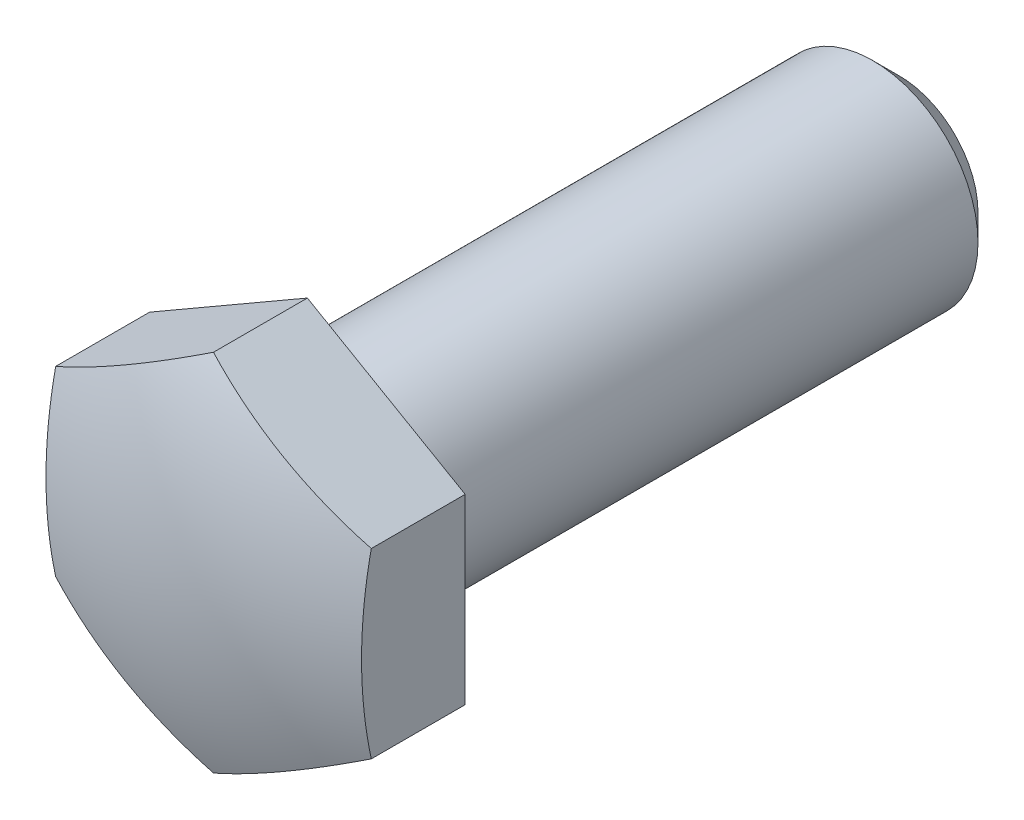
ISO-10303-21;
HEADER;
FILE_DESCRIPTION(('STEP AP214'),'2;1');
FILE_NAME('part.step','',(''),(''),'','','');
FILE_SCHEMA(('AUTOMOTIVE_DESIGN { 1 0 10303 214 1 1 1 1 }'));
ENDSEC;
DATA;
#1=APPLICATION_CONTEXT('core data for automotive mechanical design processes');
#2=APPLICATION_PROTOCOL_DEFINITION('international standard','automotive_design',2000,#1);
#3=PRODUCT_CONTEXT('',#1,'mechanical');
#4=PRODUCT('Part','Part','',(#3));
#5=PRODUCT_RELATED_PRODUCT_CATEGORY('part','',(#4));
#6=PRODUCT_DEFINITION_FORMATION('','',#4);
#7=PRODUCT_DEFINITION_CONTEXT('part definition',#1,'design');
#8=PRODUCT_DEFINITION('design','',#6,#7);
#9=PRODUCT_DEFINITION_SHAPE('','',#8);
#10=(LENGTH_UNIT() NAMED_UNIT(*) SI_UNIT(.MILLI.,.METRE.));
#11=(NAMED_UNIT(*) PLANE_ANGLE_UNIT() SI_UNIT($,.RADIAN.));
#12=(NAMED_UNIT(*) SI_UNIT($,.STERADIAN.) SOLID_ANGLE_UNIT());
#13=UNCERTAINTY_MEASURE_WITH_UNIT(LENGTH_MEASURE(1.E-05),#10,'distance_accuracy_value','');
#14=(GEOMETRIC_REPRESENTATION_CONTEXT(3) GLOBAL_UNCERTAINTY_ASSIGNED_CONTEXT((#13)) GLOBAL_UNIT_ASSIGNED_CONTEXT((#10,
#11,#12)) REPRESENTATION_CONTEXT('',''));
#15=CARTESIAN_POINT('',(0.,0.,0.));
#16=DIRECTION('',(0.,0.,1.));
#17=DIRECTION('',(1.,0.,0.));
#18=AXIS2_PLACEMENT_3D('',#15,#16,#17);
#19=CARTESIAN_POINT('',(8.,0.,0.));
#20=DIRECTION('',(0.,0.,1.));
#21=DIRECTION('',(1.,0.,0.));
#22=AXIS2_PLACEMENT_3D('',#19,#20,#21);
#23=PLANE('',#22);
#24=CARTESIAN_POINT('',(0.,0.,0.));
#25=DIRECTION('',(0.,0.,1.));
#26=DIRECTION('',(1.,0.,0.));
#27=AXIS2_PLACEMENT_3D('',#24,#25,#26);
#28=CIRCLE('',#27,8.);
#29=CARTESIAN_POINT('',(8.,0.,0.));
#30=VERTEX_POINT('',#29);
#31=EDGE_CURVE('E115',#30,#30,#28,.T.);
#32=ORIENTED_EDGE('',*,*,#31,.T.);
#33=EDGE_LOOP('',(#32));
#34=FACE_BOUND('',#33,.T.);
#35=DIRECTION('',(-0.86602540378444,-0.5,0.));
#36=VECTOR('',#35,1.);
#37=CARTESIAN_POINT('',(12.,-6.92820323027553,0.));
#38=LINE('',#37,#36);
#39=CARTESIAN_POINT('',(12.,-6.92820323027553,0.));
#40=VERTEX_POINT('',#39);
#41=CARTESIAN_POINT('',(0.,-13.856406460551,0.));
#42=VERTEX_POINT('',#41);
#43=EDGE_CURVE('E89',#40,#42,#38,.T.);
#44=ORIENTED_EDGE('',*,*,#43,.T.);
#45=DIRECTION('',(0.86602540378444,-0.5,0.));
#46=VECTOR('',#45,1.);
#47=CARTESIAN_POINT('',(-12.,-6.92820323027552,0.));
#48=LINE('',#47,#46);
#49=CARTESIAN_POINT('',(-12.,-6.92820323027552,0.));
#50=VERTEX_POINT('',#49);
#51=EDGE_CURVE('E87',#50,#42,#48,.T.);
#52=ORIENTED_EDGE('',*,*,#51,.F.);
#53=DIRECTION('',(0.,-1.,0.));
#54=VECTOR('',#53,1.);
#55=CARTESIAN_POINT('',(-12.,6.92820323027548,0.));
#56=LINE('',#55,#54);
#57=CARTESIAN_POINT('',(-12.,6.92820323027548,0.));
#58=VERTEX_POINT('',#57);
#59=EDGE_CURVE('E37',#58,#50,#56,.T.);
#60=ORIENTED_EDGE('',*,*,#59,.F.);
#61=DIRECTION('',(0.866025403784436,0.5,0.));
#62=VECTOR('',#61,1.);
#63=CARTESIAN_POINT('',(-12.,6.92820323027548,0.));
#64=LINE('',#63,#62);
#65=CARTESIAN_POINT('',(0.,13.8564064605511,0.));
#66=VERTEX_POINT('',#65);
#67=EDGE_CURVE('E77',#58,#66,#64,.T.);
#68=ORIENTED_EDGE('',*,*,#67,.T.);
#69=DIRECTION('',(-0.866025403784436,0.5,0.));
#70=VECTOR('',#69,1.);
#71=CARTESIAN_POINT('',(12.,6.92820323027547,0.));
#72=LINE('',#71,#70);
#73=CARTESIAN_POINT('',(12.,6.92820323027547,0.));
#74=VERTEX_POINT('',#73);
#75=EDGE_CURVE('E83',#74,#66,#72,.T.);
#76=ORIENTED_EDGE('',*,*,#75,.F.);
#77=DIRECTION('',(0.,-1.,0.));
#78=VECTOR('',#77,1.);
#79=CARTESIAN_POINT('',(12.,6.92820323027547,0.));
#80=LINE('',#79,#78);
#81=EDGE_CURVE('E95',#74,#40,#80,.T.);
#82=ORIENTED_EDGE('',*,*,#81,.T.);
#83=EDGE_LOOP('',(#44,#52,#60,#68,#76,#82));
#84=FACE_BOUND('',#83,.T.);
#85=ADVANCED_FACE('F14',(#34,#84),#23,.F.);
#86=CARTESIAN_POINT('',(0.,0.,15.));
#87=DIRECTION('',(0.,0.,1.));
#88=DIRECTION('',(1.,0.,0.));
#89=AXIS2_PLACEMENT_3D('',#86,#87,#88);
#90=CYLINDRICAL_SURFACE('',#89,8.);
#91=CARTESIAN_POINT('',(0.,0.,-43.));
#92=DIRECTION('',(0.,0.,1.));
#93=DIRECTION('',(1.,0.,0.));
#94=AXIS2_PLACEMENT_3D('',#91,#92,#93);
#95=CIRCLE('',#94,8.);
#96=CARTESIAN_POINT('',(8.,0.,-43.));
#97=VERTEX_POINT('',#96);
#98=EDGE_CURVE('E22',#97,#97,#95,.T.);
#99=ORIENTED_EDGE('',*,*,#98,.T.);
#100=EDGE_LOOP('',(#99));
#101=FACE_BOUND('',#100,.T.);
#102=ORIENTED_EDGE('',*,*,#31,.F.);
#103=EDGE_LOOP('',(#102));
#104=FACE_BOUND('',#103,.T.);
#105=ADVANCED_FACE('F120',(#101,#104),#90,.T.);
#106=CARTESIAN_POINT('',(0.,0.,-45.));
#107=DIRECTION('',(0.,0.,1.));
#108=DIRECTION('',(1.,0.,0.));
#109=AXIS2_PLACEMENT_3D('',#106,#107,#108);
#110=PLANE('',#109);
#111=CARTESIAN_POINT('',(0.,0.,-45.));
#112=DIRECTION('',(0.,0.,1.));
#113=DIRECTION('',(1.,0.,0.));
#114=AXIS2_PLACEMENT_3D('',#111,#112,#113);
#115=CIRCLE('',#114,6.);
#116=CARTESIAN_POINT('',(6.,0.,-45.));
#117=VERTEX_POINT('',#116);
#118=EDGE_CURVE('E9',#117,#117,#115,.F.);
#119=ORIENTED_EDGE('',*,*,#118,.T.);
#120=EDGE_LOOP('',(#119));
#121=FACE_BOUND('',#120,.T.);
#122=ADVANCED_FACE('F141',(#121),#110,.F.);
#123=CARTESIAN_POINT('',(12.,-6.92820323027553,10.));
#124=DIRECTION('',(0.5,-0.86602540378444,0.));
#125=DIRECTION('',(0.86602540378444,0.5,0.));
#126=AXIS2_PLACEMENT_3D('',#123,#124,#125);
#127=PLANE('',#126);
#128=DIRECTION('',(0.,0.,-1.));
#129=VECTOR('',#128,1.);
#130=CARTESIAN_POINT('',(0.,-13.856406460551,10.));
#131=LINE('',#130,#129);
#132=CARTESIAN_POINT('',(0.,-13.856406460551,7.1403173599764));
#133=VERTEX_POINT('',#132);
#134=EDGE_CURVE('E29',#133,#42,#131,.T.);
#135=ORIENTED_EDGE('',*,*,#134,.T.);
#136=ORIENTED_EDGE('',*,*,#43,.F.);
#137=DIRECTION('',(0.,0.,-1.));
#138=VECTOR('',#137,1.);
#139=CARTESIAN_POINT('',(12.,-6.92820323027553,10.));
#140=LINE('',#139,#138);
#141=CARTESIAN_POINT('',(12.,-6.92820323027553,7.1403173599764));
#142=VERTEX_POINT('',#141);
#143=EDGE_CURVE('E100',#142,#40,#140,.T.);
#144=ORIENTED_EDGE('',*,*,#143,.F.);
#145=CARTESIAN_POINT('',(6.,-10.3923048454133,-25.));
#146=DIRECTION('',(0.5,-0.86602540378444,0.));
#147=DIRECTION('',(0.86602540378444,0.5,0.));
#148=AXIS2_PLACEMENT_3D('',#145,#146,#147);
#149=CIRCLE('',#148,32.8785644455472);
#150=EDGE_CURVE('E112',#133,#142,#149,.F.);
#151=ORIENTED_EDGE('',*,*,#150,.F.);
#152=EDGE_LOOP('',(#135,#136,#144,#151));
#153=FACE_BOUND('',#152,.T.);
#154=ADVANCED_FACE('F146',(#153),#127,.T.);
#155=CARTESIAN_POINT('',(12.,6.92820323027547,10.));
#156=DIRECTION('',(1.,0.,0.));
#157=DIRECTION('',(0.,1.,0.));
#158=AXIS2_PLACEMENT_3D('',#155,#156,#157);
#159=PLANE('',#158);
#160=ORIENTED_EDGE('',*,*,#143,.T.);
#161=ORIENTED_EDGE('',*,*,#81,.F.);
#162=DIRECTION('',(0.,0.,-1.));
#163=VECTOR('',#162,1.);
#164=CARTESIAN_POINT('',(12.,6.92820323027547,10.));
#165=LINE('',#164,#163);
#166=CARTESIAN_POINT('',(12.,6.92820323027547,7.1403173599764));
#167=VERTEX_POINT('',#166);
#168=EDGE_CURVE('E98',#167,#74,#165,.T.);
#169=ORIENTED_EDGE('',*,*,#168,.F.);
#170=CARTESIAN_POINT('',(12.,0.,-25.));
#171=DIRECTION('',(1.,0.,0.));
#172=DIRECTION('',(0.,1.,0.));
#173=AXIS2_PLACEMENT_3D('',#170,#171,#172);
#174=CIRCLE('',#173,32.8785644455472);
#175=EDGE_CURVE('E109',#142,#167,#174,.F.);
#176=ORIENTED_EDGE('',*,*,#175,.F.);
#177=EDGE_LOOP('',(#160,#161,#169,#176));
#178=FACE_BOUND('',#177,.T.);
#179=ADVANCED_FACE('F148',(#178),#159,.T.);
#180=CARTESIAN_POINT('',(12.,6.92820323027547,10.));
#181=DIRECTION('',(-0.5,-0.866025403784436,0.));
#182=DIRECTION('',(0.866025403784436,-0.5,0.));
#183=AXIS2_PLACEMENT_3D('',#180,#181,#182);
#184=PLANE('',#183);
#185=CARTESIAN_POINT('',(6.,10.3923048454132,-25.));
#186=DIRECTION('',(-0.5,-0.866025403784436,0.));
#187=DIRECTION('',(0.866025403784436,-0.5,0.));
#188=AXIS2_PLACEMENT_3D('',#185,#186,#187);
#189=CIRCLE('',#188,32.8785644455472);
#190=CARTESIAN_POINT('',(0.,13.8564064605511,7.1403173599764));
#191=VERTEX_POINT('',#190);
#192=EDGE_CURVE('E107',#191,#167,#189,.F.);
#193=ORIENTED_EDGE('',*,*,#192,.T.);
#194=ORIENTED_EDGE('',*,*,#168,.T.);
#195=ORIENTED_EDGE('',*,*,#75,.T.);
#196=DIRECTION('',(0.,0.,-1.));
#197=VECTOR('',#196,1.);
#198=CARTESIAN_POINT('',(0.,13.8564064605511,10.));
#199=LINE('',#198,#197);
#200=EDGE_CURVE('E73',#191,#66,#199,.T.);
#201=ORIENTED_EDGE('',*,*,#200,.F.);
#202=EDGE_LOOP('',(#193,#194,#195,#201));
#203=FACE_BOUND('',#202,.T.);
#204=ADVANCED_FACE('F151',(#203),#184,.F.);
#205=CARTESIAN_POINT('',(-12.,6.92820323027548,10.));
#206=DIRECTION('',(-0.5,0.866025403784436,0.));
#207=DIRECTION('',(-0.866025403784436,-0.5,0.));
#208=AXIS2_PLACEMENT_3D('',#205,#206,#207);
#209=PLANE('',#208);
#210=ORIENTED_EDGE('',*,*,#200,.T.);
#211=ORIENTED_EDGE('',*,*,#67,.F.);
#212=DIRECTION('',(0.,0.,-1.));
#213=VECTOR('',#212,1.);
#214=CARTESIAN_POINT('',(-12.,6.92820323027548,10.));
#215=LINE('',#214,#213);
#216=CARTESIAN_POINT('',(-12.,6.92820323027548,7.1403173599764));
#217=VERTEX_POINT('',#216);
#218=EDGE_CURVE('E66',#217,#58,#215,.T.);
#219=ORIENTED_EDGE('',*,*,#218,.F.);
#220=CARTESIAN_POINT('',(-6.,10.3923048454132,-25.));
#221=DIRECTION('',(-0.5,0.866025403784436,0.));
#222=DIRECTION('',(-0.866025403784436,-0.5,0.));
#223=AXIS2_PLACEMENT_3D('',#220,#221,#222);
#224=CIRCLE('',#223,32.8785644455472);
#225=EDGE_CURVE('E105',#191,#217,#224,.F.);
#226=ORIENTED_EDGE('',*,*,#225,.F.);
#227=EDGE_LOOP('',(#210,#211,#219,#226));
#228=FACE_BOUND('',#227,.T.);
#229=ADVANCED_FACE('F78',(#228),#209,.T.);
#230=CARTESIAN_POINT('',(-12.,6.92820323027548,10.));
#231=DIRECTION('',(1.,0.,0.));
#232=DIRECTION('',(0.,0.,-1.));
#233=AXIS2_PLACEMENT_3D('',#230,#231,#232);
#234=PLANE('',#233);
#235=CARTESIAN_POINT('',(-12.,0.,-25.));
#236=DIRECTION('',(1.,0.,0.));
#237=DIRECTION('',(0.,0.,-1.));
#238=AXIS2_PLACEMENT_3D('',#235,#236,#237);
#239=CIRCLE('',#238,32.8785644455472);
#240=CARTESIAN_POINT('',(-12.,-6.92820323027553,7.1403173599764));
#241=VERTEX_POINT('',#240);
#242=EDGE_CURVE('E70',#241,#217,#239,.F.);
#243=ORIENTED_EDGE('',*,*,#242,.T.);
#244=ORIENTED_EDGE('',*,*,#218,.T.);
#245=ORIENTED_EDGE('',*,*,#59,.T.);
#246=DIRECTION('',(0.,0.,-1.));
#247=VECTOR('',#246,1.);
#248=CARTESIAN_POINT('',(-12.,-6.92820323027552,10.));
#249=LINE('',#248,#247);
#250=EDGE_CURVE('E74',#241,#50,#249,.T.);
#251=ORIENTED_EDGE('',*,*,#250,.F.);
#252=EDGE_LOOP('',(#243,#244,#245,#251));
#253=FACE_BOUND('',#252,.T.);
#254=ADVANCED_FACE('F68',(#253),#234,.F.);
#255=CARTESIAN_POINT('',(-12.,-6.92820323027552,10.));
#256=DIRECTION('',(0.5,0.86602540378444,0.));
#257=DIRECTION('',(-0.86602540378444,0.5,0.));
#258=AXIS2_PLACEMENT_3D('',#255,#256,#257);
#259=PLANE('',#258);
#260=CARTESIAN_POINT('',(-6.,-10.3923048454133,-25.));
#261=DIRECTION('',(0.5,0.86602540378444,0.));
#262=DIRECTION('',(-0.86602540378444,0.5,0.));
#263=AXIS2_PLACEMENT_3D('',#260,#261,#262);
#264=CIRCLE('',#263,32.8785644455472);
#265=EDGE_CURVE('E102',#133,#241,#264,.F.);
#266=ORIENTED_EDGE('',*,*,#265,.T.);
#267=ORIENTED_EDGE('',*,*,#250,.T.);
#268=ORIENTED_EDGE('',*,*,#51,.T.);
#269=ORIENTED_EDGE('',*,*,#134,.F.);
#270=EDGE_LOOP('',(#266,#267,#268,#269));
#271=FACE_BOUND('',#270,.T.);
#272=ADVANCED_FACE('F131',(#271),#259,.F.);
#273=CARTESIAN_POINT('',(0.,0.,-25.));
#274=DIRECTION('',(0.,0.,1.));
#275=DIRECTION('',(1.,0.,0.));
#276=AXIS2_PLACEMENT_3D('',#273,#274,#275);
#277=SPHERICAL_SURFACE('',#276,35.);
#278=ORIENTED_EDGE('',*,*,#265,.F.);
#279=ORIENTED_EDGE('',*,*,#150,.T.);
#280=ORIENTED_EDGE('',*,*,#175,.T.);
#281=ORIENTED_EDGE('',*,*,#192,.F.);
#282=ORIENTED_EDGE('',*,*,#225,.T.);
#283=ORIENTED_EDGE('',*,*,#242,.F.);
#284=EDGE_LOOP('',(#278,#279,#280,#281,#282,#283));
#285=FACE_BOUND('',#284,.T.);
#286=ADVANCED_FACE('F124',(#285),#277,.T.);
#287=CARTESIAN_POINT('',(0.,0.,-43.));
#288=DIRECTION('',(0.,0.,1.));
#289=DIRECTION('',(1.,0.,0.));
#290=AXIS2_PLACEMENT_3D('',#287,#288,#289);
#291=CONICAL_SURFACE('',#290,8.,0.78539816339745);
#292=ORIENTED_EDGE('',*,*,#118,.F.);
#293=EDGE_LOOP('',(#292));
#294=FACE_BOUND('',#293,.T.);
#295=ORIENTED_EDGE('',*,*,#98,.F.);
#296=EDGE_LOOP('',(#295));
#297=FACE_BOUND('',#296,.T.);
#298=ADVANCED_FACE('F16',(#294,#297),#291,.T.);
#299=CLOSED_SHELL('',(#85,#105,#122,#154,#179,#204,#229,#254,#272,#286,#298));
#300=MANIFOLD_SOLID_BREP('B1',#299);
#301=ADVANCED_BREP_SHAPE_REPRESENTATION('',(#18,#300),#14);
#302=SHAPE_DEFINITION_REPRESENTATION(#9,#301);
ENDSEC;
END-ISO-10303-21;
